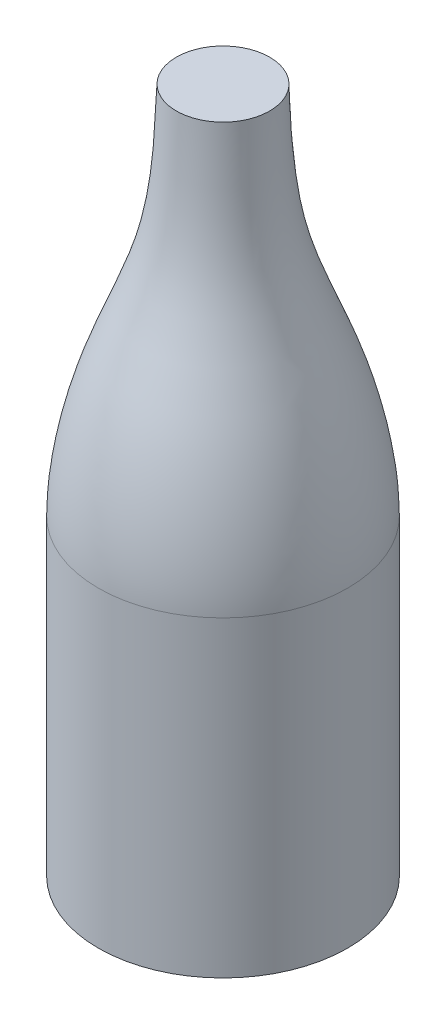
ISO-10303-21;
HEADER;
FILE_DESCRIPTION(('STEP AP214'),'2;1');
FILE_NAME('part.step','',(''),(''),'','','');
FILE_SCHEMA(('AUTOMOTIVE_DESIGN { 1 0 10303 214 1 1 1 1 }'));
ENDSEC;
DATA;
#1=APPLICATION_CONTEXT('core data for automotive mechanical design processes');
#2=APPLICATION_PROTOCOL_DEFINITION('international standard','automotive_design',2000,#1);
#3=PRODUCT_CONTEXT('',#1,'mechanical');
#4=PRODUCT('Part','Part','',(#3));
#5=PRODUCT_RELATED_PRODUCT_CATEGORY('part','',(#4));
#6=PRODUCT_DEFINITION_FORMATION('','',#4);
#7=PRODUCT_DEFINITION_CONTEXT('part definition',#1,'design');
#8=PRODUCT_DEFINITION('design','',#6,#7);
#9=PRODUCT_DEFINITION_SHAPE('','',#8);
#10=(LENGTH_UNIT() NAMED_UNIT(*) SI_UNIT(.MILLI.,.METRE.));
#11=(NAMED_UNIT(*) PLANE_ANGLE_UNIT() SI_UNIT($,.RADIAN.));
#12=(NAMED_UNIT(*) SI_UNIT($,.STERADIAN.) SOLID_ANGLE_UNIT());
#13=UNCERTAINTY_MEASURE_WITH_UNIT(LENGTH_MEASURE(1.E-05),#10,'distance_accuracy_value','');
#14=(GEOMETRIC_REPRESENTATION_CONTEXT(3) GLOBAL_UNCERTAINTY_ASSIGNED_CONTEXT((#13)) GLOBAL_UNIT_ASSIGNED_CONTEXT((#10,
#11,#12)) REPRESENTATION_CONTEXT('',''));
#15=CARTESIAN_POINT('',(0.,0.,0.));
#16=DIRECTION('',(0.,0.,1.));
#17=DIRECTION('',(1.,0.,0.));
#18=AXIS2_PLACEMENT_3D('',#15,#16,#17);
#19=CARTESIAN_POINT('',(7.48388406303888,110.,0.));
#20=DIRECTION('',(0.,1.,0.));
#21=DIRECTION('',(0.,0.,1.));
#22=AXIS2_PLACEMENT_3D('',#19,#20,#21);
#23=PLANE('',#22);
#24=CARTESIAN_POINT('',(0.,110.,0.));
#25=DIRECTION('',(0.,-1.,0.));
#26=DIRECTION('',(0.,0.,-1.));
#27=AXIS2_PLACEMENT_3D('',#24,#25,#26);
#28=CIRCLE('',#27,7.48388406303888);
#29=CARTESIAN_POINT('',(0.,110.,-7.48388406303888));
#30=VERTEX_POINT('',#29);
#31=EDGE_CURVE('E10',#30,#30,#28,.T.);
#32=ORIENTED_EDGE('',*,*,#31,.F.);
#33=EDGE_LOOP('',(#32));
#34=FACE_BOUND('',#33,.T.);
#35=ADVANCED_FACE('F29',(#34),#23,.T.);
#36=CARTESIAN_POINT('',(20.,50.,0.));
#37=CARTESIAN_POINT('',(20.,56.2765683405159,0.));
#38=CARTESIAN_POINT('',(17.1722067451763,70.5611762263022,0.));
#39=CARTESIAN_POINT('',(8.26097720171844,88.9080822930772,0.));
#40=CARTESIAN_POINT('',(7.7546973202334,102.649567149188,0.));
#41=CARTESIAN_POINT('',(7.48388406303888,110.,0.));
#42=B_SPLINE_CURVE_WITH_KNOTS('',3,(#36,#37,#38,#39,#40,#41),.UNSPECIFIED.,.F.,.F.,(4,1,1,4),
(0.,0.341056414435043,0.647525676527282,1.),.UNSPECIFIED.);
#43=CARTESIAN_POINT('',(0.,0.,0.));
#44=DIRECTION('',(0.,-1.,0.));
#45=AXIS1_PLACEMENT('',#43,#44);
#46=SURFACE_OF_REVOLUTION('',#42,#45);
#47=ORIENTED_EDGE('',*,*,#31,.T.);
#48=EDGE_LOOP('',(#47));
#49=FACE_BOUND('',#48,.T.);
#50=CARTESIAN_POINT('',(0.,50.,0.));
#51=DIRECTION('',(0.,-1.,0.));
#52=DIRECTION('',(0.,0.,-1.));
#53=AXIS2_PLACEMENT_3D('',#50,#51,#52);
#54=CIRCLE('',#53,20.);
#55=CARTESIAN_POINT('',(0.,50.,-20.));
#56=VERTEX_POINT('',#55);
#57=EDGE_CURVE('E35',#56,#56,#54,.T.);
#58=ORIENTED_EDGE('',*,*,#57,.F.);
#59=EDGE_LOOP('',(#58));
#60=FACE_BOUND('',#59,.T.);
#61=ADVANCED_FACE('F51',(#49,#60),#46,.F.);
#62=CARTESIAN_POINT('',(0.,0.,0.));
#63=DIRECTION('',(0.,-1.,0.));
#64=DIRECTION('',(0.,0.,-1.));
#65=AXIS2_PLACEMENT_3D('',#62,#63,#64);
#66=CYLINDRICAL_SURFACE('',#65,20.);
#67=ORIENTED_EDGE('',*,*,#57,.T.);
#68=EDGE_LOOP('',(#67));
#69=FACE_BOUND('',#68,.T.);
#70=CARTESIAN_POINT('',(0.,0.,0.));
#71=DIRECTION('',(0.,-1.,0.));
#72=DIRECTION('',(0.,0.,-1.));
#73=AXIS2_PLACEMENT_3D('',#70,#71,#72);
#74=CIRCLE('',#73,20.);
#75=CARTESIAN_POINT('',(0.,0.,-20.));
#76=VERTEX_POINT('',#75);
#77=EDGE_CURVE('E39',#76,#76,#74,.T.);
#78=ORIENTED_EDGE('',*,*,#77,.F.);
#79=EDGE_LOOP('',(#78));
#80=FACE_BOUND('',#79,.T.);
#81=ADVANCED_FACE('F54',(#69,#80),#66,.T.);
#82=CARTESIAN_POINT('',(0.,0.,0.));
#83=DIRECTION('',(0.,-1.,0.));
#84=DIRECTION('',(0.,0.,-1.));
#85=AXIS2_PLACEMENT_3D('',#82,#83,#84);
#86=PLANE('',#85);
#87=ORIENTED_EDGE('',*,*,#77,.T.);
#88=EDGE_LOOP('',(#87));
#89=FACE_BOUND('',#88,.T.);
#90=ADVANCED_FACE('F57',(#89),#86,.T.);
#91=CLOSED_SHELL('',(#35,#61,#81,#90));
#92=MANIFOLD_SOLID_BREP('B2',#91);
#93=ADVANCED_BREP_SHAPE_REPRESENTATION('',(#18,#92),#14);
#94=SHAPE_DEFINITION_REPRESENTATION(#9,#93);
ENDSEC;
END-ISO-10303-21;
